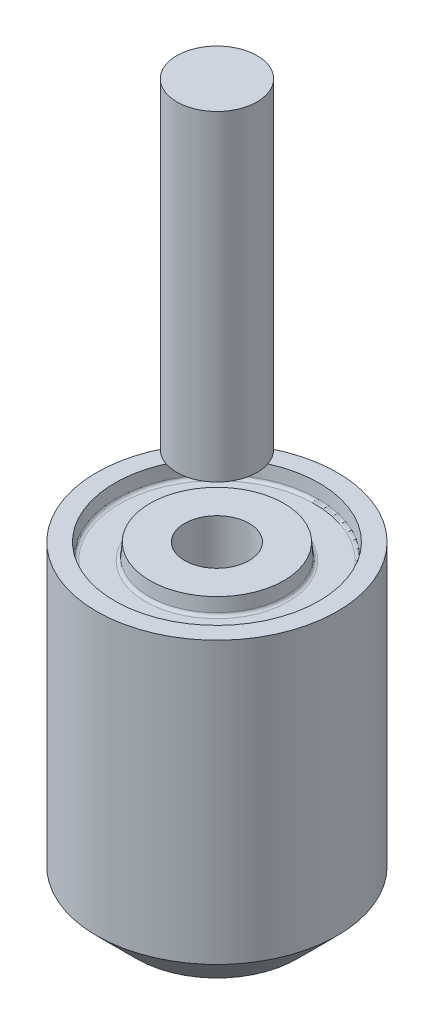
ISO-10303-21;
HEADER;
FILE_DESCRIPTION(('STEP AP214'),'2;1');
FILE_NAME('part.step','',(''),(''),'','','');
FILE_SCHEMA(('AUTOMOTIVE_DESIGN { 1 0 10303 214 1 1 1 1 }'));
ENDSEC;
DATA;
#1=APPLICATION_CONTEXT('core data for automotive mechanical design processes');
#2=APPLICATION_PROTOCOL_DEFINITION('international standard','automotive_design',2000,#1);
#3=PRODUCT_CONTEXT('',#1,'mechanical');
#4=PRODUCT('Part','Part','',(#3));
#5=PRODUCT_RELATED_PRODUCT_CATEGORY('part','',(#4));
#6=PRODUCT_DEFINITION_FORMATION('','',#4);
#7=PRODUCT_DEFINITION_CONTEXT('part definition',#1,'design');
#8=PRODUCT_DEFINITION('design','',#6,#7);
#9=PRODUCT_DEFINITION_SHAPE('','',#8);
#10=(LENGTH_UNIT() NAMED_UNIT(*) SI_UNIT(.MILLI.,.METRE.));
#11=(NAMED_UNIT(*) PLANE_ANGLE_UNIT() SI_UNIT($,.RADIAN.));
#12=(NAMED_UNIT(*) SI_UNIT($,.STERADIAN.) SOLID_ANGLE_UNIT());
#13=UNCERTAINTY_MEASURE_WITH_UNIT(LENGTH_MEASURE(1.E-05),#10,'distance_accuracy_value','');
#14=(GEOMETRIC_REPRESENTATION_CONTEXT(3) GLOBAL_UNCERTAINTY_ASSIGNED_CONTEXT((#13)) GLOBAL_UNIT_ASSIGNED_CONTEXT((#10,
#11,#12)) REPRESENTATION_CONTEXT('',''));
#15=CARTESIAN_POINT('',(0.,0.,0.));
#16=DIRECTION('',(0.,0.,1.));
#17=DIRECTION('',(1.,0.,0.));
#18=AXIS2_PLACEMENT_3D('',#15,#16,#17);
#19=CARTESIAN_POINT('',(0.,31.75,0.));
#20=DIRECTION('',(0.,-1.,0.));
#21=DIRECTION('',(0.,0.,-1.));
#22=AXIS2_PLACEMENT_3D('',#19,#20,#21);
#23=CYLINDRICAL_SURFACE('',#22,3.175);
#24=CARTESIAN_POINT('',(0.,31.75,0.));
#25=DIRECTION('',(0.,1.,0.));
#26=DIRECTION('',(0.,0.,1.));
#27=AXIS2_PLACEMENT_3D('',#24,#25,#26);
#28=CIRCLE('',#27,3.175);
#29=CARTESIAN_POINT('',(0.,31.75,3.175));
#30=VERTEX_POINT('',#29);
#31=EDGE_CURVE('E11',#30,#30,#28,.T.);
#32=ORIENTED_EDGE('',*,*,#31,.F.);
#33=EDGE_LOOP('',(#32));
#34=FACE_BOUND('',#33,.T.);
#35=CARTESIAN_POINT('',(0.,6.35,0.));
#36=DIRECTION('',(0.,1.,0.));
#37=DIRECTION('',(0.,0.,1.));
#38=AXIS2_PLACEMENT_3D('',#35,#36,#37);
#39=CIRCLE('',#38,3.175);
#40=CARTESIAN_POINT('',(0.,6.35,3.175));
#41=VERTEX_POINT('',#40);
#42=EDGE_CURVE('E49',#41,#41,#39,.T.);
#43=ORIENTED_EDGE('',*,*,#42,.T.);
#44=EDGE_LOOP('',(#43));
#45=FACE_BOUND('',#44,.T.);
#46=ADVANCED_FACE('F46',(#34,#45),#23,.T.);
#47=CARTESIAN_POINT('',(0.,31.75,0.));
#48=DIRECTION('',(0.,1.,0.));
#49=DIRECTION('',(0.,0.,1.));
#50=AXIS2_PLACEMENT_3D('',#47,#48,#49);
#51=PLANE('',#50);
#52=ORIENTED_EDGE('',*,*,#31,.T.);
#53=EDGE_LOOP('',(#52));
#54=FACE_BOUND('',#53,.T.);
#55=ADVANCED_FACE('F61',(#54),#51,.T.);
#56=CARTESIAN_POINT('',(0.,6.35,0.));
#57=DIRECTION('',(0.,1.,0.));
#58=DIRECTION('',(0.,0.,1.));
#59=AXIS2_PLACEMENT_3D('',#56,#57,#58);
#60=PLANE('',#59);
#61=ORIENTED_EDGE('',*,*,#42,.F.);
#62=EDGE_LOOP('',(#61));
#63=FACE_BOUND('',#62,.T.);
#64=ADVANCED_FACE('F59',(#63),#60,.F.);
#65=CLOSED_SHELL('',(#46,#55,#64));
#66=MANIFOLD_SOLID_BREP('B2',#65);
#67=CARTESIAN_POINT('',(0.,-25.4,0.));
#68=DIRECTION('',(0.,1.,0.));
#69=DIRECTION('',(0.,0.,1.));
#70=AXIS2_PLACEMENT_3D('',#67,#68,#69);
#71=CYLINDRICAL_SURFACE('',#70,9.525);
#72=CARTESIAN_POINT('',(0.,-22.225,0.));
#73=DIRECTION('',(0.,1.,0.));
#74=DIRECTION('',(0.,0.,1.));
#75=AXIS2_PLACEMENT_3D('',#72,#73,#74);
#76=CIRCLE('',#75,9.525);
#77=CARTESIAN_POINT('',(0.,-22.225,9.525));
#78=VERTEX_POINT('',#77);
#79=EDGE_CURVE('E93',#78,#78,#76,.T.);
#80=ORIENTED_EDGE('',*,*,#79,.T.);
#81=EDGE_LOOP('',(#80));
#82=FACE_BOUND('',#81,.T.);
#83=CARTESIAN_POINT('',(0.,0.,0.));
#84=DIRECTION('',(0.,1.,0.));
#85=DIRECTION('',(0.,0.,1.));
#86=AXIS2_PLACEMENT_3D('',#83,#84,#85);
#87=CIRCLE('',#86,9.525);
#88=CARTESIAN_POINT('',(0.,0.,9.525));
#89=VERTEX_POINT('',#88);
#90=EDGE_CURVE('E106',#89,#89,#87,.T.);
#91=ORIENTED_EDGE('',*,*,#90,.F.);
#92=EDGE_LOOP('',(#91));
#93=FACE_BOUND('',#92,.T.);
#94=ADVANCED_FACE('F86',(#82,#93),#71,.T.);
#95=CARTESIAN_POINT('',(0.,-25.4,0.));
#96=DIRECTION('',(0.,1.,0.));
#97=DIRECTION('',(0.,0.,1.));
#98=AXIS2_PLACEMENT_3D('',#95,#96,#97);
#99=PLANE('',#98);
#100=CARTESIAN_POINT('',(0.,-25.4,0.));
#101=DIRECTION('',(0.,1.,0.));
#102=DIRECTION('',(0.,0.,1.));
#103=AXIS2_PLACEMENT_3D('',#100,#101,#102);
#104=CIRCLE('',#103,6.34999999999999);
#105=CARTESIAN_POINT('',(0.,-25.4,6.34999999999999));
#106=VERTEX_POINT('',#105);
#107=EDGE_CURVE('E44',#106,#106,#104,.F.);
#108=ORIENTED_EDGE('',*,*,#107,.T.);
#109=EDGE_LOOP('',(#108));
#110=FACE_BOUND('',#109,.T.);
#111=ADVANCED_FACE('F131',(#110),#99,.F.);
#112=CARTESIAN_POINT('',(0.,0.,0.));
#113=DIRECTION('',(0.,1.,0.));
#114=DIRECTION('',(0.,0.,1.));
#115=AXIS2_PLACEMENT_3D('',#112,#113,#114);
#116=PLANE('',#115);
#117=CARTESIAN_POINT('',(0.,0.,0.));
#118=DIRECTION('',(0.,-1.,0.));
#119=DIRECTION('',(1.,0.,0.));
#120=AXIS2_PLACEMENT_3D('',#117,#118,#119);
#121=CIRCLE('',#120,8.08671060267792);
#122=CARTESIAN_POINT('',(8.08671060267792,0.,0.));
#123=VERTEX_POINT('',#122);
#124=EDGE_CURVE('E173',#123,#123,#121,.T.);
#125=ORIENTED_EDGE('',*,*,#124,.T.);
#126=EDGE_LOOP('',(#125));
#127=FACE_BOUND('',#126,.T.);
#128=ORIENTED_EDGE('',*,*,#90,.T.);
#129=EDGE_LOOP('',(#128));
#130=FACE_BOUND('',#129,.T.);
#131=ADVANCED_FACE('F122',(#127,#130),#116,.T.);
#132=CARTESIAN_POINT('',(0.,-22.225,0.));
#133=DIRECTION('',(0.,1.,0.));
#134=DIRECTION('',(0.,0.,1.));
#135=AXIS2_PLACEMENT_3D('',#132,#133,#134);
#136=CONICAL_SURFACE('',#135,9.525,0.785398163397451);
#137=ORIENTED_EDGE('',*,*,#107,.F.);
#138=EDGE_LOOP('',(#137));
#139=FACE_BOUND('',#138,.T.);
#140=ORIENTED_EDGE('',*,*,#79,.F.);
#141=EDGE_LOOP('',(#140));
#142=FACE_BOUND('',#141,.T.);
#143=ADVANCED_FACE('F88',(#139,#142),#136,.T.);
#144=CARTESIAN_POINT('',(0.,-1.016,0.));
#145=DIRECTION('',(0.,-1.,0.));
#146=DIRECTION('',(1.,0.,0.));
#147=AXIS2_PLACEMENT_3D('',#144,#145,#146);
#148=TOROIDAL_SURFACE('',#147,5.64294811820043,0.254);
#149=CARTESIAN_POINT('',(0.,-1.27,0.));
#150=DIRECTION('',(0.,-1.,0.));
#151=DIRECTION('',(1.,0.,0.));
#152=AXIS2_PLACEMENT_3D('',#149,#150,#151);
#153=CIRCLE('',#152,5.64294811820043);
#154=CARTESIAN_POINT('',(5.64294811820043,-1.27,0.));
#155=VERTEX_POINT('',#154);
#156=EDGE_CURVE('E166',#155,#155,#153,.T.);
#157=ORIENTED_EDGE('',*,*,#156,.F.);
#158=EDGE_LOOP('',(#157));
#159=FACE_BOUND('',#158,.T.);
#160=CARTESIAN_POINT('',(0.,-1.03813755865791,0.));
#161=DIRECTION('',(0.,-1.,0.));
#162=DIRECTION('',(1.,0.,0.));
#163=AXIS2_PLACEMENT_3D('',#160,#161,#162);
#164=CIRCLE('',#163,5.38991466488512);
#165=CARTESIAN_POINT('',(5.38991466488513,-1.03813755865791,0.));
#166=VERTEX_POINT('',#165);
#167=EDGE_CURVE('E112',#166,#166,#164,.T.);
#168=ORIENTED_EDGE('',*,*,#167,.T.);
#169=EDGE_LOOP('',(#168));
#170=FACE_BOUND('',#169,.T.);
#171=ADVANCED_FACE('F121',(#159,#170),#148,.F.);
#172=CARTESIAN_POINT('',(0.,0.,0.));
#173=DIRECTION('',(0.,-1.,0.));
#174=DIRECTION('',(1.,0.,0.));
#175=AXIS2_PLACEMENT_3D('',#172,#173,#174);
#176=CONICAL_SURFACE('',#175,5.29908939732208,0.087266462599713);
#177=ORIENTED_EDGE('',*,*,#167,.F.);
#178=EDGE_LOOP('',(#177));
#179=FACE_BOUND('',#178,.T.);
#180=CARTESIAN_POINT('',(0.,0.,0.));
#181=DIRECTION('',(0.,-1.,0.));
#182=DIRECTION('',(1.,0.,0.));
#183=AXIS2_PLACEMENT_3D('',#180,#181,#182);
#184=CIRCLE('',#183,5.29908939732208);
#185=CARTESIAN_POINT('',(5.29908939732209,0.,0.));
#186=VERTEX_POINT('',#185);
#187=EDGE_CURVE('E176',#186,#186,#184,.T.);
#188=ORIENTED_EDGE('',*,*,#187,.T.);
#189=EDGE_LOOP('',(#188));
#190=FACE_BOUND('',#189,.T.);
#191=ADVANCED_FACE('F128',(#179,#190),#176,.T.);
#192=CARTESIAN_POINT('',(0.,-1.03813755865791,0.));
#193=DIRECTION('',(0.,1.,0.));
#194=DIRECTION('',(-1.,0.,0.));
#195=AXIS2_PLACEMENT_3D('',#192,#193,#194);
#196=CONICAL_SURFACE('',#195,7.99588533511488,0.0872664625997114);
#197=ORIENTED_EDGE('',*,*,#124,.F.);
#198=EDGE_LOOP('',(#197));
#199=FACE_BOUND('',#198,.T.);
#200=CARTESIAN_POINT('',(0.,-1.03813755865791,0.));
#201=DIRECTION('',(0.,-1.,0.));
#202=DIRECTION('',(1.,0.,0.));
#203=AXIS2_PLACEMENT_3D('',#200,#201,#202);
#204=CIRCLE('',#203,7.99588533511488);
#205=CARTESIAN_POINT('',(7.99588533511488,-1.03813755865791,0.));
#206=VERTEX_POINT('',#205);
#207=EDGE_CURVE('E168',#206,#206,#204,.T.);
#208=ORIENTED_EDGE('',*,*,#207,.T.);
#209=EDGE_LOOP('',(#208));
#210=FACE_BOUND('',#209,.T.);
#211=ADVANCED_FACE('F147',(#199,#210),#196,.F.);
#212=CARTESIAN_POINT('',(0.,-1.016,0.));
#213=DIRECTION('',(0.,-1.,0.));
#214=DIRECTION('',(1.,0.,0.));
#215=AXIS2_PLACEMENT_3D('',#212,#213,#214);
#216=TOROIDAL_SURFACE('',#215,7.74285188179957,0.254);
#217=ORIENTED_EDGE('',*,*,#207,.F.);
#218=EDGE_LOOP('',(#217));
#219=FACE_BOUND('',#218,.T.);
#220=CARTESIAN_POINT('',(0.,-1.27,0.));
#221=DIRECTION('',(0.,-1.,0.));
#222=DIRECTION('',(1.,0.,0.));
#223=AXIS2_PLACEMENT_3D('',#220,#221,#222);
#224=CIRCLE('',#223,7.74285188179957);
#225=CARTESIAN_POINT('',(7.74285188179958,-1.27,0.));
#226=VERTEX_POINT('',#225);
#227=EDGE_CURVE('E163',#226,#226,#224,.T.);
#228=ORIENTED_EDGE('',*,*,#227,.T.);
#229=EDGE_LOOP('',(#228));
#230=FACE_BOUND('',#229,.T.);
#231=ADVANCED_FACE('F151',(#219,#230),#216,.F.);
#232=CARTESIAN_POINT('',(7.74285188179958,-1.27,0.));
#233=DIRECTION('',(0.,-1.,0.));
#234=DIRECTION('',(1.,0.,0.));
#235=AXIS2_PLACEMENT_3D('',#232,#233,#234);
#236=PLANE('',#235);
#237=ORIENTED_EDGE('',*,*,#227,.F.);
#238=EDGE_LOOP('',(#237));
#239=FACE_BOUND('',#238,.T.);
#240=ORIENTED_EDGE('',*,*,#156,.T.);
#241=EDGE_LOOP('',(#240));
#242=FACE_BOUND('',#241,.T.);
#243=ADVANCED_FACE('F100',(#239,#242),#236,.F.);
#244=CARTESIAN_POINT('',(0.,-17.3228,0.));
#245=DIRECTION('',(0.,1.,0.));
#246=DIRECTION('',(0.,0.,1.));
#247=AXIS2_PLACEMENT_3D('',#244,#245,#246);
#248=CONICAL_SURFACE('',#247,2.5527,1.02974425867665);
#249=CARTESIAN_POINT('',(0.,-18.8566169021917,0.));
#250=VERTEX_POINT('',#249);
#251=VERTEX_LOOP('',#250);
#252=FACE_BOUND('',#251,.T.);
#253=CARTESIAN_POINT('',(0.,-17.3228,0.));
#254=DIRECTION('',(0.,1.,0.));
#255=DIRECTION('',(0.,0.,1.));
#256=AXIS2_PLACEMENT_3D('',#253,#254,#255);
#257=CIRCLE('',#256,2.5527);
#258=CARTESIAN_POINT('',(0.,-17.3228,2.5527));
#259=VERTEX_POINT('',#258);
#260=EDGE_CURVE('E104',#259,#259,#257,.T.);
#261=ORIENTED_EDGE('',*,*,#260,.T.);
#262=EDGE_LOOP('',(#261));
#263=FACE_BOUND('',#262,.T.);
#264=ADVANCED_FACE('F96',(#252,#263),#248,.F.);
#265=CARTESIAN_POINT('',(0.,0.,0.));
#266=DIRECTION('',(0.,1.,0.));
#267=DIRECTION('',(0.,0.,1.));
#268=AXIS2_PLACEMENT_3D('',#265,#266,#267);
#269=CYLINDRICAL_SURFACE('',#268,2.55269999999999);
#270=ORIENTED_EDGE('',*,*,#260,.F.);
#271=EDGE_LOOP('',(#270));
#272=FACE_BOUND('',#271,.T.);
#273=CARTESIAN_POINT('',(0.,0.,0.));
#274=DIRECTION('',(0.,1.,0.));
#275=DIRECTION('',(0.,0.,1.));
#276=AXIS2_PLACEMENT_3D('',#273,#274,#275);
#277=CIRCLE('',#276,2.55269999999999);
#278=CARTESIAN_POINT('',(0.,0.,2.55269999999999));
#279=VERTEX_POINT('',#278);
#280=EDGE_CURVE('E107',#279,#279,#277,.T.);
#281=ORIENTED_EDGE('',*,*,#280,.T.);
#282=EDGE_LOOP('',(#281));
#283=FACE_BOUND('',#282,.T.);
#284=ADVANCED_FACE('F99',(#272,#283),#269,.F.);
#285=ORIENTED_EDGE('',*,*,#187,.F.);
#286=EDGE_LOOP('',(#285));
#287=FACE_BOUND('',#286,.T.);
#288=ORIENTED_EDGE('',*,*,#280,.F.);
#289=EDGE_LOOP('',(#288));
#290=FACE_BOUND('',#289,.T.);
#291=ADVANCED_FACE('F134',(#287,#290),#116,.T.);
#292=CLOSED_SHELL('',(#94,#111,#131,#143,#171,#191,#211,#231,#243,#264,#284,#291));
#293=MANIFOLD_SOLID_BREP('B6_NOT_SHOWN',#292);
#294=ADVANCED_BREP_SHAPE_REPRESENTATION('',(#18,#66,#293),#14);
#295=SHAPE_DEFINITION_REPRESENTATION(#9,#294);
ENDSEC;
END-ISO-10303-21;
